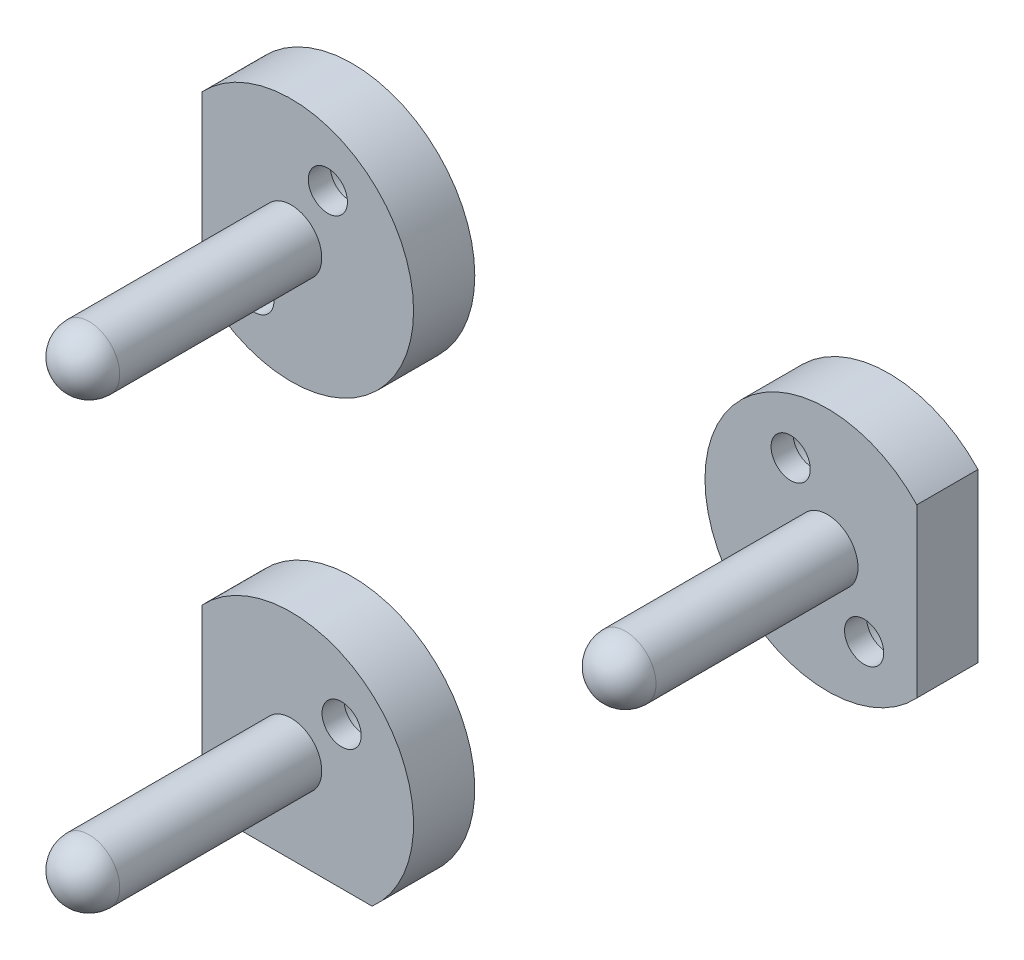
from build123d import *

# Parameters (mm, degrees)
SKETCH_1_R          = 10
EXTRUDE_1_DEPTH     = 5
EXTRUDE_1_2_DEPTH   = 5
EXTRUDE_1_3_DEPTH   = 5
SKETCH_2_R          = 2.5
EXTRUDE_2_DEPTH     = 19
FILLET_4_R          = 2.5
FILLET_5_R          = 2.5
FILLET_6_R          = 2.5
CUT_EXTRUDE_1_DEPTH = 10
SKETCH_5_R          = 2.85
CUT_EXTRUDE_2_DEPTH = 3.2
CUT_EXTRUDE_3_REACH = 46.821
SKETCH_6_R          = 1.6


with BuildPart() as part:
    # Sketch 1 → Extrude 1 (new body)
    with BuildSketch(Plane.XY):
        with Locations((-21.9, 16.9)):
            Circle(SKETCH_1_R)
    extrude(amount=EXTRUDE_1_DEPTH)



with BuildPart() as body_2:
    # Sketch 1 → Extrude 1 2 (new body)
    with BuildSketch(Plane.XY):
        with Locations((-21.9, -19.4)):
            Circle(SKETCH_1_R)
    extrude(amount=EXTRUDE_1_2_DEPTH)


with BuildPart() as body_3:
    # Sketch 1 → Extrude 1 3 (new body)
    with BuildSketch(Plane.XY):
        with Locations(Location((21.9, 16.9, 0), (0, 0, 180))):
            Circle(SKETCH_1_R)
    extrude(amount=EXTRUDE_1_3_DEPTH)


with BuildPart() as part_1:
    add(part.part)

    add(body_2.part)  # Extrude 2 merges body 2

    add(body_3.part)  # Extrude 2 merges body 3
    # Sketch 2 → Extrude 2 (add)
    with BuildSketch(Plane.XY.offset(5)):
        with Locations((-21.9, 16.9)):
            Circle(SKETCH_2_R)
        with Locations((21.9, 16.9)):
            Circle(SKETCH_2_R)
        with Locations((-21.9, -19.4)):
            Circle(SKETCH_2_R)
    extrude(amount=EXTRUDE_2_DEPTH)

    # Fillet 4
    fillet_4_edges = [part_1.edges().sort_by_distance(p)[0] for p in [
        (-24.4, 16.9, 24),
    ]]
    fillet(fillet_4_edges, radius=FILLET_4_R)

    # Fillet 5
    fillet_5_edges = [part_1.edges().sort_by_distance(p)[0] for p in [
        (-24.4, -19.4, 24),
    ]]
    fillet(fillet_5_edges, radius=FILLET_5_R)

    # Fillet 6
    fillet_6_edges = [part_1.edges().sort_by_distance(p)[0] for p in [
        (19.4, 16.9, 24),
    ]]
    fillet(fillet_6_edges, radius=FILLET_6_R)

    # Sketch 4 → Cut-Extrude 1 (cut)
    with BuildSketch(Plane(origin=(0, 0, 0), x_dir=(-1, 0, 0), z_dir=(0, 0, -1))):
        with BuildLine():
            Line((28.514378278, -26.9), (15.285621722, -26.9))
            ThreePointArc((15.285621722, -26.9), (21.9, -29.4), (28.514378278, -26.9))
        make_face()
        with BuildLine():
            ThreePointArc((-29.2, 23.73447145), (-31.9, 16.9), (-29.2, 10.06552855))
            Line((-29.2, 10.06552855), (-29.2, 23.73447145))
        make_face()
        with BuildLine():
            ThreePointArc((29.2, 23.73447145), (31.9, 16.9), (29.2, 10.06552855))
            Line((29.2, 10.06552855), (29.2, 23.73447145))
        make_face()
        with BuildLine():
            ThreePointArc((29.2, -12.56552855), (31.9, -19.4), (29.2, -26.23447145))
            Line((29.2, -26.23447145), (29.2, -12.56552855))
        make_face()
    extrude(amount=-CUT_EXTRUDE_1_DEPTH, mode=Mode.SUBTRACT)

    # Sketch 5 → Cut-Extrude 2 (cut)
    with BuildSketch(Plane(origin=(0, 0, 0), x_dir=(-1, 0, 0), z_dir=(0, 0, -1))):
        with Locations((-18.9, 21.9)):
            Circle(SKETCH_5_R)
        with Locations(Location((26.023105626, -23.523105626, 0), (0, 0, 180))):
            Circle(SKETCH_5_R)
        with Locations((-24.9, 11.9)):
            Circle(SKETCH_5_R)
        with Locations(Location((24.9, 11.9, 0), (0, 0, 180))):
            Circle(SKETCH_5_R)
        with Locations(Location((18.9, 21.9, 0), (0, 0, 180))):
            Circle(SKETCH_5_R)
        with Locations(Location((17.776894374, -15.276894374, 0), (0, 0, 180))):
            Circle(SKETCH_5_R)
    extrude(amount=-CUT_EXTRUDE_2_DEPTH, mode=Mode.SUBTRACT)

    # Sketch 6 → Cut-Extrude 3 (cut, up to next)
    with BuildSketch(Plane(origin=(0, 0, 3.2), x_dir=(-1, 0, 0), z_dir=(0, 0, -1)), mode=Mode.PRIVATE) as cut_extrude_3_sk1:
        with Locations((-18.9, 21.9)):
            Circle(SKETCH_6_R)
    cut_extrude_3_tool1 = extrude(cut_extrude_3_sk1.sketch, amount=-CUT_EXTRUDE_3_REACH, mode=Mode.PRIVATE) & part_1.part
    # Sketch 6 → Cut-Extrude 3 (cut, up to next)
    with BuildSketch(Plane(origin=(0, 0, 3.2), x_dir=(-1, 0, 0), z_dir=(0, 0, -1)), mode=Mode.PRIVATE) as cut_extrude_3_sk2:
        with Locations((-24.9, 11.9)):
            Circle(SKETCH_6_R)
    cut_extrude_3_tool2 = extrude(cut_extrude_3_sk2.sketch, amount=-CUT_EXTRUDE_3_REACH, mode=Mode.PRIVATE) & part_1.part
    # Sketch 6 → Cut-Extrude 3 (cut, up to next)
    with BuildSketch(Plane(origin=(0, 0, 3.2), x_dir=(-1, 0, 0), z_dir=(0, 0, -1)), mode=Mode.PRIVATE) as cut_extrude_3_sk3:
        with Locations((18.9, 21.9)):
            Circle(SKETCH_6_R)
    cut_extrude_3_tool3 = extrude(cut_extrude_3_sk3.sketch, amount=-CUT_EXTRUDE_3_REACH, mode=Mode.PRIVATE) & part_1.part
    # Sketch 6 → Cut-Extrude 3 (cut, up to next)
    with BuildSketch(Plane(origin=(0, 0, 3.2), x_dir=(-1, 0, 0), z_dir=(0, 0, -1)), mode=Mode.PRIVATE) as cut_extrude_3_sk4:
        with Locations((24.9, 11.9)):
            Circle(SKETCH_6_R)
    cut_extrude_3_tool4 = extrude(cut_extrude_3_sk4.sketch, amount=-CUT_EXTRUDE_3_REACH, mode=Mode.PRIVATE) & part_1.part
    # Sketch 6 → Cut-Extrude 3 (cut, up to next)
    with BuildSketch(Plane(origin=(0, 0, 3.2), x_dir=(-1, 0, 0), z_dir=(0, 0, -1)), mode=Mode.PRIVATE) as cut_extrude_3_sk5:
        with Locations((17.776894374, -15.276894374)):
            Circle(SKETCH_6_R)
    cut_extrude_3_tool5 = extrude(cut_extrude_3_sk5.sketch, amount=-CUT_EXTRUDE_3_REACH, mode=Mode.PRIVATE) & part_1.part
    # Sketch 6 → Cut-Extrude 3 (cut, up to next)
    with BuildSketch(Plane(origin=(0, 0, 3.2), x_dir=(-1, 0, 0), z_dir=(0, 0, -1)), mode=Mode.PRIVATE) as cut_extrude_3_sk6:
        with Locations((26.023105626, -23.523105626)):
            Circle(SKETCH_6_R)
    cut_extrude_3_tool6 = extrude(cut_extrude_3_sk6.sketch, amount=-CUT_EXTRUDE_3_REACH, mode=Mode.PRIVATE) & part_1.part
    add(cut_extrude_3_tool1.solids().sort_by_distance((18.9, 21.9, 3.2))[0], mode=Mode.SUBTRACT)
    add(cut_extrude_3_tool2.solids().sort_by_distance((24.9, 11.9, 3.2))[0], mode=Mode.SUBTRACT)
    add(cut_extrude_3_tool3.solids().sort_by_distance((-18.9, 21.9, 3.2))[0], mode=Mode.SUBTRACT)
    add(cut_extrude_3_tool4.solids().sort_by_distance((-24.9, 11.9, 3.2))[0], mode=Mode.SUBTRACT)
    add(cut_extrude_3_tool5.solids().sort_by_distance((-17.776894, -15.276894, 3.2))[0], mode=Mode.SUBTRACT)
    add(cut_extrude_3_tool6.solids().sort_by_distance((-26.023106, -23.523106, 3.2))[0], mode=Mode.SUBTRACT)


solid = part_1.part
